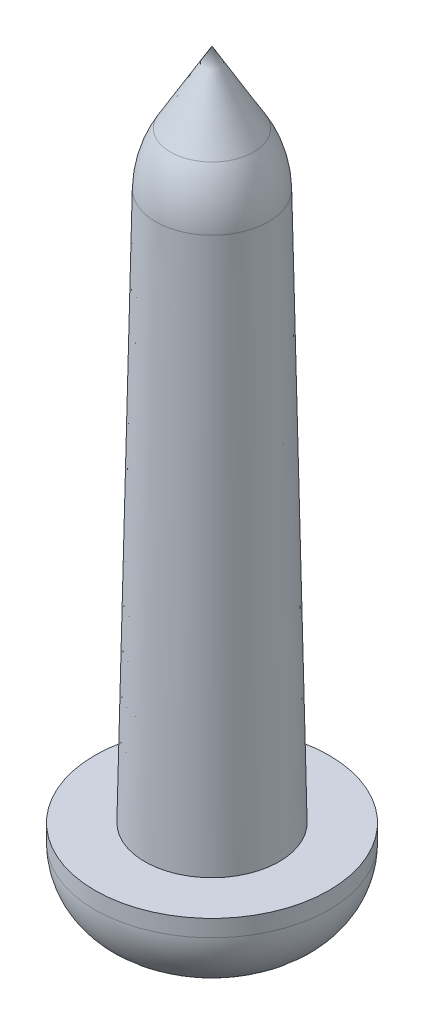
ISO-10303-21;
HEADER;
FILE_DESCRIPTION(('STEP AP214'),'2;1');
FILE_NAME('part.step','',(''),(''),'','','');
FILE_SCHEMA(('AUTOMOTIVE_DESIGN { 1 0 10303 214 1 1 1 1 }'));
ENDSEC;
DATA;
#1=APPLICATION_CONTEXT('core data for automotive mechanical design processes');
#2=APPLICATION_PROTOCOL_DEFINITION('international standard','automotive_design',2000,#1);
#3=PRODUCT_CONTEXT('',#1,'mechanical');
#4=PRODUCT('Part','Part','',(#3));
#5=PRODUCT_RELATED_PRODUCT_CATEGORY('part','',(#4));
#6=PRODUCT_DEFINITION_FORMATION('','',#4);
#7=PRODUCT_DEFINITION_CONTEXT('part definition',#1,'design');
#8=PRODUCT_DEFINITION('design','',#6,#7);
#9=PRODUCT_DEFINITION_SHAPE('','',#8);
#10=(LENGTH_UNIT() NAMED_UNIT(*) SI_UNIT(.MILLI.,.METRE.));
#11=(NAMED_UNIT(*) PLANE_ANGLE_UNIT() SI_UNIT($,.RADIAN.));
#12=(NAMED_UNIT(*) SI_UNIT($,.STERADIAN.) SOLID_ANGLE_UNIT());
#13=UNCERTAINTY_MEASURE_WITH_UNIT(LENGTH_MEASURE(1.E-05),#10,'distance_accuracy_value','');
#14=(GEOMETRIC_REPRESENTATION_CONTEXT(3) GLOBAL_UNCERTAINTY_ASSIGNED_CONTEXT((#13)) GLOBAL_UNIT_ASSIGNED_CONTEXT((#10,
#11,#12)) REPRESENTATION_CONTEXT('',''));
#15=CARTESIAN_POINT('',(0.,0.,0.));
#16=DIRECTION('',(0.,0.,1.));
#17=DIRECTION('',(1.,0.,0.));
#18=AXIS2_PLACEMENT_3D('',#15,#16,#17);
#19=CARTESIAN_POINT('',(0.,4.31540969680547E-06,0.));
#20=DIRECTION('',(0.,-1.,0.));
#21=DIRECTION('',(0.,0.,-1.));
#22=AXIS2_PLACEMENT_3D('',#19,#20,#21);
#23=PLANE('',#22);
#24=DIRECTION('',(-1.,0.,0.));
#25=VECTOR('',#24,1.);
#26=CARTESIAN_POINT('',(0.,4.31540969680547E-06,0.349999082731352));
#27=LINE('',#26,#25);
#28=CARTESIAN_POINT('',(0.652004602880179,1.16357725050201E-06,0.350000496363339));
#29=VERTEX_POINT('',#28);
#30=CARTESIAN_POINT('',(0.55,4.3154096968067E-06,0.349999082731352));
#31=VERTEX_POINT('',#30);
#32=EDGE_CURVE('E104',#29,#31,#27,.T.);
#33=ORIENTED_EDGE('',*,*,#32,.F.);
#34=CARTESIAN_POINT('',(0.,8.63081939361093E-06,0.));
#35=DIRECTION('',(0.,-1.,0.));
#36=DIRECTION('',(0.,0.,-1.));
#37=AXIS2_PLACEMENT_3D('',#34,#35,#36);
#38=CIRCLE('',#37,0.74001166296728);
#39=CARTESIAN_POINT('',(0.349998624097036,6.47311451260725E-06,0.652007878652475));
#40=VERTEX_POINT('',#39);
#41=EDGE_CURVE('E342',#29,#40,#38,.T.);
#42=ORIENTED_EDGE('',*,*,#41,.T.);
#43=DIRECTION('',(0.,0.,1.));
#44=VECTOR('',#43,1.);
#45=CARTESIAN_POINT('',(0.349999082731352,4.31540969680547E-06,0.));
#46=LINE('',#45,#44);
#47=CARTESIAN_POINT('',(0.349999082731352,4.3154096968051E-06,0.55));
#48=VERTEX_POINT('',#47);
#49=EDGE_CURVE('E124',#48,#40,#46,.T.);
#50=ORIENTED_EDGE('',*,*,#49,.F.);
#51=CARTESIAN_POINT('',(0.55,4.31540969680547E-06,0.55));
#52=DIRECTION('',(0.,-1.,0.));
#53=DIRECTION('',(0.,0.,-1.));
#54=AXIS2_PLACEMENT_3D('',#51,#52,#53);
#55=CIRCLE('',#54,0.200000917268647);
#56=EDGE_CURVE('E116',#31,#48,#55,.F.);
#57=ORIENTED_EDGE('',*,*,#56,.F.);
#58=EDGE_LOOP('',(#33,#42,#50,#57));
#59=FACE_BOUND('',#58,.T.);
#60=ADVANCED_FACE('F33',(#59),#23,.T.);
#61=DIRECTION('',(0.,0.,-1.));
#62=VECTOR('',#61,1.);
#63=CARTESIAN_POINT('',(-0.349999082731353,4.31540969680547E-06,0.));
#64=LINE('',#63,#62);
#65=CARTESIAN_POINT('',(-0.35000049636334,1.1635772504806E-06,0.652004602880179));
#66=VERTEX_POINT('',#65);
#67=CARTESIAN_POINT('',(-0.349999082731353,4.31540969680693E-06,0.55));
#68=VERTEX_POINT('',#67);
#69=EDGE_CURVE('E126',#66,#68,#64,.T.);
#70=ORIENTED_EDGE('',*,*,#69,.F.);
#71=CARTESIAN_POINT('',(-0.652007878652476,6.47311451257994E-06,0.349998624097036));
#72=VERTEX_POINT('',#71);
#73=EDGE_CURVE('E345',#66,#72,#38,.T.);
#74=ORIENTED_EDGE('',*,*,#73,.T.);
#75=DIRECTION('',(-1.,0.,0.));
#76=VECTOR('',#75,1.);
#77=CARTESIAN_POINT('',(0.,4.31540969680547E-06,0.349999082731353));
#78=LINE('',#77,#76);
#79=CARTESIAN_POINT('',(-0.55,4.31540969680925E-06,0.349999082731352));
#80=VERTEX_POINT('',#79);
#81=EDGE_CURVE('E135',#80,#72,#78,.T.);
#82=ORIENTED_EDGE('',*,*,#81,.F.);
#83=CARTESIAN_POINT('',(-0.55,4.31540969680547E-06,0.55));
#84=DIRECTION('',(0.,-1.,0.));
#85=DIRECTION('',(0.,0.,-1.));
#86=AXIS2_PLACEMENT_3D('',#83,#84,#85);
#87=CIRCLE('',#86,0.200000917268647);
#88=EDGE_CURVE('E132',#68,#80,#87,.F.);
#89=ORIENTED_EDGE('',*,*,#88,.F.);
#90=EDGE_LOOP('',(#70,#74,#82,#89));
#91=FACE_BOUND('',#90,.T.);
#92=ADVANCED_FACE('F313',(#91),#23,.T.);
#93=DIRECTION('',(1.,0.,0.));
#94=VECTOR('',#93,1.);
#95=CARTESIAN_POINT('',(0.,4.31540969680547E-06,-0.349999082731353));
#96=LINE('',#95,#94);
#97=CARTESIAN_POINT('',(-0.652004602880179,1.16357725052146E-06,-0.350000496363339));
#98=VERTEX_POINT('',#97);
#99=CARTESIAN_POINT('',(-0.55,4.31540969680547E-06,-0.349999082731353));
#100=VERTEX_POINT('',#99);
#101=EDGE_CURVE('E137',#98,#100,#96,.T.);
#102=ORIENTED_EDGE('',*,*,#101,.F.);
#103=CARTESIAN_POINT('',(-0.349998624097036,6.47311451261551E-06,-0.652007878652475));
#104=VERTEX_POINT('',#103);
#105=EDGE_CURVE('E358',#98,#104,#38,.T.);
#106=ORIENTED_EDGE('',*,*,#105,.T.);
#107=DIRECTION('',(0.,0.,-1.));
#108=VECTOR('',#107,1.);
#109=CARTESIAN_POINT('',(-0.349999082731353,4.31540969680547E-06,0.));
#110=LINE('',#109,#108);
#111=CARTESIAN_POINT('',(-0.349999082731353,4.3154096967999E-06,-0.55));
#112=VERTEX_POINT('',#111);
#113=EDGE_CURVE('E144',#112,#104,#110,.T.);
#114=ORIENTED_EDGE('',*,*,#113,.F.);
#115=CARTESIAN_POINT('',(-0.55,4.31540969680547E-06,-0.55));
#116=DIRECTION('',(0.,-1.,0.));
#117=DIRECTION('',(0.,0.,-1.));
#118=AXIS2_PLACEMENT_3D('',#115,#116,#117);
#119=CIRCLE('',#118,0.200000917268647);
#120=EDGE_CURVE('E141',#100,#112,#119,.F.);
#121=ORIENTED_EDGE('',*,*,#120,.F.);
#122=EDGE_LOOP('',(#102,#106,#114,#121));
#123=FACE_BOUND('',#122,.T.);
#124=ADVANCED_FACE('F317',(#123),#23,.T.);
#125=DIRECTION('',(0.,0.,1.));
#126=VECTOR('',#125,1.);
#127=CARTESIAN_POINT('',(0.349999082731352,4.31540969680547E-06,0.));
#128=LINE('',#127,#126);
#129=CARTESIAN_POINT('',(0.350000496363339,1.16357725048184E-06,-0.652004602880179));
#130=VERTEX_POINT('',#129);
#131=CARTESIAN_POINT('',(0.349999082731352,4.31540969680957E-06,-0.55));
#132=VERTEX_POINT('',#131);
#133=EDGE_CURVE('E146',#130,#132,#128,.T.);
#134=ORIENTED_EDGE('',*,*,#133,.F.);
#135=CARTESIAN_POINT('',(0.652007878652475,6.47311451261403E-06,-0.349998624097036));
#136=VERTEX_POINT('',#135);
#137=EDGE_CURVE('E333',#130,#136,#38,.T.);
#138=ORIENTED_EDGE('',*,*,#137,.T.);
#139=DIRECTION('',(1.,0.,0.));
#140=VECTOR('',#139,1.);
#141=CARTESIAN_POINT('',(0.,4.31540969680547E-06,-0.349999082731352));
#142=LINE('',#141,#140);
#143=CARTESIAN_POINT('',(0.55,4.31540969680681E-06,-0.349999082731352));
#144=VERTEX_POINT('',#143);
#145=EDGE_CURVE('E153',#144,#136,#142,.T.);
#146=ORIENTED_EDGE('',*,*,#145,.F.);
#147=CARTESIAN_POINT('',(0.55,4.31540969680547E-06,-0.55));
#148=DIRECTION('',(0.,-1.,0.));
#149=DIRECTION('',(0.,0.,-1.));
#150=AXIS2_PLACEMENT_3D('',#147,#148,#149);
#151=CIRCLE('',#150,0.200000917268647);
#152=EDGE_CURVE('E150',#132,#144,#151,.F.);
#153=ORIENTED_EDGE('',*,*,#152,.F.);
#154=EDGE_LOOP('',(#134,#138,#146,#153));
#155=FACE_BOUND('',#154,.T.);
#156=ADVANCED_FACE('F35',(#155),#23,.T.);
#157=CARTESIAN_POINT('',(0.,1.00000863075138,0.));
#158=DIRECTION('',(0.,-1.,0.));
#159=DIRECTION('',(0.,0.,-1.));
#160=AXIS2_PLACEMENT_3D('',#157,#158,#159);
#161=DEGENERATE_TOROIDAL_SURFACE('',#160,0.739999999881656,1.,.T.);
#162=CARTESIAN_POINT('',(0.26933841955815,0.379482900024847,-1.50020000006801));
#163=CARTESIAN_POINT('',(0.274102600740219,0.357069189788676,-1.48132507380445));
#164=CARTESIAN_POINT('',(0.278695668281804,0.335460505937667,-1.46147507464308));
#165=CARTESIAN_POINT('',(0.287512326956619,0.293981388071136,-1.41996635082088));
#166=CARTESIAN_POINT('',(0.291735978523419,0.274110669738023,-1.39830792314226));
#167=CARTESIAN_POINT('',(0.30376985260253,0.217495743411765,-1.33107012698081));
#168=CARTESIAN_POINT('',(0.310996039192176,0.183499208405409,-1.28301716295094));
#169=CARTESIAN_POINT('',(0.323683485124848,0.123809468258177,-1.18182195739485));
#170=CARTESIAN_POINT('',(0.3291441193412,0.0981192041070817,-1.12867792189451));
#171=CARTESIAN_POINT('',(0.338198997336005,0.0555193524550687,-1.01870742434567));
#172=CARTESIAN_POINT('',(0.341790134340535,0.0386243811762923,-0.961875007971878));
#173=CARTESIAN_POINT('',(0.345749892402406,0.0199951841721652,-0.875059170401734));
#174=CARTESIAN_POINT('',(0.346832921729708,0.0148999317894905,-0.845781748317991));
#175=CARTESIAN_POINT('',(0.348526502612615,0.0069322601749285,-0.786899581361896));
#176=CARTESIAN_POINT('',(0.349136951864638,0.00406032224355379,-0.757294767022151));
#177=CARTESIAN_POINT('',(0.349897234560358,0.000483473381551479,-0.698008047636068));
#178=CARTESIAN_POINT('',(0.35004789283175,-0.000225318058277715,-0.668326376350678));
#179=CARTESIAN_POINT('',(0.349919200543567,0.000380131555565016,-0.609001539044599));
#180=CARTESIAN_POINT('',(0.349640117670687,0.00169311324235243,-0.579358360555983));
#181=CARTESIAN_POINT('',(0.34916036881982,0.00395015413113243,-0.549799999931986));
#182=B_SPLINE_CURVE_WITH_KNOTS('',3,(#162,#163,#164,#165,#166,#167,#168,#169,#170,#171,#172,
#173,#174,#175,#176,#177,#178,#179,#180,#181),.UNSPECIFIED.,.F.,.F.,(4,2,2,2,2,2,2,2,2,4),(0.,
0.0890046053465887,0.177994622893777,0.354994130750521,0.532056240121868,0.709411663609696,
0.798550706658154,0.887709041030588,0.976707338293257,1.06565022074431),.UNSPECIFIED.);
#183=CARTESIAN_POINT('',(0.284428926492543,0.308487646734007,-1.43442892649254));
#184=VERTEX_POINT('',#183);
#185=EDGE_CURVE('E11',#184,#130,#182,.T.);
#186=ORIENTED_EDGE('',*,*,#185,.F.);
#187=CARTESIAN_POINT('',(-0.350200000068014,0.320863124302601,-1.43179843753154));
#188=CARTESIAN_POINT('',(-0.303864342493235,0.311157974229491,-1.43386133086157));
#189=CARTESIAN_POINT('',(-0.257100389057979,0.303497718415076,-1.43548956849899));
#190=CARTESIAN_POINT('',(-0.163042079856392,0.292112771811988,-1.43790951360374));
#191=CARTESIAN_POINT('',(-0.115747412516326,0.288390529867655,-1.43870070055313));
#192=CARTESIAN_POINT('',(-0.0212573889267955,0.284748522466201,-1.43947483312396));
#193=CARTESIAN_POINT('',(0.0259372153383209,0.284809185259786,-1.43946193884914));
#194=CARTESIAN_POINT('',(0.120143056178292,0.288692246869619,-1.4386365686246));
#195=CARTESIAN_POINT('',(0.16715439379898,0.292512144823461,-1.4378246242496));
#196=CARTESIAN_POINT('',(0.236724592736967,0.301085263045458,-1.43600235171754));
#197=CARTESIAN_POINT('',(0.259481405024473,0.304359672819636,-1.43530635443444));
#198=CARTESIAN_POINT('',(0.304927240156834,0.311876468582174,-1.43370861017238));
#199=CARTESIAN_POINT('',(0.327615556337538,0.316122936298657,-1.43280599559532));
#200=CARTESIAN_POINT('',(0.350200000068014,0.3208631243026,-1.43179843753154));
#201=B_SPLINE_CURVE_WITH_KNOTS('',3,(#187,#188,#189,#190,#191,#192,#193,#194,#195,#196,#197,
#198,#199,#200),.UNSPECIFIED.,.F.,.F.,(4,2,2,2,2,2,4),(0.,0.14208299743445,0.284254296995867,
0.425690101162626,0.567031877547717,0.63601873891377,0.705300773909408),.UNSPECIFIED.);
#202=CARTESIAN_POINT('',(-0.284428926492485,0.308487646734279,-1.43442892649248));
#203=VERTEX_POINT('',#202);
#204=EDGE_CURVE('E43',#203,#184,#201,.T.);
#205=ORIENTED_EDGE('',*,*,#204,.F.);
#206=CARTESIAN_POINT('',(-0.34916036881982,0.00395015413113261,-0.549799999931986));
#207=CARTESIAN_POINT('',(-0.349716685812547,0.00133288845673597,-0.583987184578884));
#208=CARTESIAN_POINT('',(-0.350002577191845,-1.2124734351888E-05,-0.618292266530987));
#209=CARTESIAN_POINT('',(-0.349993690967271,2.9681665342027E-05,-0.686928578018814));
#210=CARTESIAN_POINT('',(-0.349698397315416,0.00141892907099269,-0.721259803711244));
#211=CARTESIAN_POINT('',(-0.348484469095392,0.00713001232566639,-0.789774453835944));
#212=CARTESIAN_POINT('',(-0.34756406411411,0.011460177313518,-0.823957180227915));
#213=CARTESIAN_POINT('',(-0.345083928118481,0.023128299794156,-0.891760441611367));
#214=CARTESIAN_POINT('',(-0.343524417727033,0.0304652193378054,-0.925381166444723));
#215=CARTESIAN_POINT('',(-0.337924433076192,0.0568110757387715,-1.02411488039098));
#216=CARTESIAN_POINT('',(-0.332946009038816,0.0802327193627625,-1.08806501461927));
#217=CARTESIAN_POINT('',(-0.320576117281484,0.138428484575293,-1.21009001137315));
#218=CARTESIAN_POINT('',(-0.313192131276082,0.173167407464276,-1.26818236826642));
#219=CARTESIAN_POINT('',(-0.29958334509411,0.237191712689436,-1.35514117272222));
#220=CARTESIAN_POINT('',(-0.294041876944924,0.263262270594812,-1.38652660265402));
#221=CARTESIAN_POINT('',(-0.282223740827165,0.318862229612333,-1.44597253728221));
#222=CARTESIAN_POINT('',(-0.275946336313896,0.348395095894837,-1.47402965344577));
#223=CARTESIAN_POINT('',(-0.26933841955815,0.379482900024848,-1.50020000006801));
#224=B_SPLINE_CURVE_WITH_KNOTS('',3,(#206,#207,#208,#209,#210,#211,#212,#213,#214,#215,#216,
#217,#218,#219,#220,#221,#222,#223),.UNSPECIFIED.,.F.,.F.,(4,2,2,2,2,2,2,2,4),(0.,
0.10287413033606,0.205839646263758,0.309097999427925,0.412320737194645,0.615903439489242,
0.818858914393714,0.942120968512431,1.06550745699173),.UNSPECIFIED.);
#225=EDGE_CURVE('E294',#104,#203,#224,.T.);
#226=ORIENTED_EDGE('',*,*,#225,.F.);
#227=ORIENTED_EDGE('',*,*,#105,.F.);
#228=CARTESIAN_POINT('',(-1.50020000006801,0.379482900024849,-0.269338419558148));
#229=CARTESIAN_POINT('',(-1.48132507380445,0.357069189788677,-0.274102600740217));
#230=CARTESIAN_POINT('',(-1.46147507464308,0.335460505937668,-0.278695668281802));
#231=CARTESIAN_POINT('',(-1.41996635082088,0.293981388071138,-0.287512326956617));
#232=CARTESIAN_POINT('',(-1.39830792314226,0.274110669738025,-0.291735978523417));
#233=CARTESIAN_POINT('',(-1.33107012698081,0.217495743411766,-0.303769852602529));
#234=CARTESIAN_POINT('',(-1.28301716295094,0.18349920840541,-0.310996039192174));
#235=CARTESIAN_POINT('',(-1.18182195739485,0.123809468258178,-0.323683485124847));
#236=CARTESIAN_POINT('',(-1.12867792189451,0.0981192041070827,-0.329144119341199));
#237=CARTESIAN_POINT('',(-1.01870742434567,0.0555193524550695,-0.338198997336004));
#238=CARTESIAN_POINT('',(-0.96187500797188,0.0386243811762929,-0.341790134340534));
#239=CARTESIAN_POINT('',(-0.875059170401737,0.0199951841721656,-0.345749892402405));
#240=CARTESIAN_POINT('',(-0.845781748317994,0.0148999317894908,-0.346832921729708));
#241=CARTESIAN_POINT('',(-0.786899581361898,0.00693226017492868,-0.348526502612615));
#242=CARTESIAN_POINT('',(-0.757294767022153,0.00406032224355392,-0.349136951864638));
#243=CARTESIAN_POINT('',(-0.698008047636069,0.000483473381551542,-0.349897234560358));
#244=CARTESIAN_POINT('',(-0.66832637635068,-0.000225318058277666,-0.350047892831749));
#245=CARTESIAN_POINT('',(-0.6090015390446,0.000380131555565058,-0.349919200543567));
#246=CARTESIAN_POINT('',(-0.579358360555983,0.00169311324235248,-0.349640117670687));
#247=CARTESIAN_POINT('',(-0.549799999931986,0.00395015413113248,-0.34916036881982));
#248=B_SPLINE_CURVE_WITH_KNOTS('',3,(#228,#229,#230,#231,#232,#233,#234,#235,#236,#237,#238,
#239,#240,#241,#242,#243,#244,#245,#246,#247),.UNSPECIFIED.,.F.,.F.,(4,2,2,2,2,2,2,2,2,4),(0.,
0.0890046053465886,0.177994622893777,0.354994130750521,0.532056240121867,0.709411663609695,
0.798550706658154,0.887709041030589,0.976707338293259,1.06565022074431),.UNSPECIFIED.);
#249=CARTESIAN_POINT('',(-1.43442892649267,0.308487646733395,-0.284428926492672));
#250=VERTEX_POINT('',#249);
#251=EDGE_CURVE('E293',#250,#98,#248,.T.);
#252=ORIENTED_EDGE('',*,*,#251,.F.);
#253=CARTESIAN_POINT('',(-1.43179843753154,0.320863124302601,0.350200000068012));
#254=CARTESIAN_POINT('',(-1.43386133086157,0.311157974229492,0.303864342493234));
#255=CARTESIAN_POINT('',(-1.435489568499,0.303497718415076,0.257100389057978));
#256=CARTESIAN_POINT('',(-1.43790951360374,0.292112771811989,0.163042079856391));
#257=CARTESIAN_POINT('',(-1.43870070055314,0.288390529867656,0.115747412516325));
#258=CARTESIAN_POINT('',(-1.43947483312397,0.284748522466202,0.021257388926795));
#259=CARTESIAN_POINT('',(-1.43946193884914,0.284809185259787,-0.0259372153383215));
#260=CARTESIAN_POINT('',(-1.4386365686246,0.28869224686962,-0.120143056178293));
#261=CARTESIAN_POINT('',(-1.4378246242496,0.292512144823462,-0.16715439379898));
#262=CARTESIAN_POINT('',(-1.43600235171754,0.301085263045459,-0.236724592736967));
#263=CARTESIAN_POINT('',(-1.43530635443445,0.304359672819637,-0.259481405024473));
#264=CARTESIAN_POINT('',(-1.43370861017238,0.311876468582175,-0.304927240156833));
#265=CARTESIAN_POINT('',(-1.43280599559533,0.316122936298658,-0.327615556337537));
#266=CARTESIAN_POINT('',(-1.43179843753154,0.320863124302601,-0.350200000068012));
#267=B_SPLINE_CURVE_WITH_KNOTS('',3,(#253,#254,#255,#256,#257,#258,#259,#260,#261,#262,#263,
#264,#265,#266),.UNSPECIFIED.,.F.,.F.,(4,2,2,2,2,2,4),(0.,0.142082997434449,0.284254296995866,
0.425690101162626,0.567031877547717,0.636018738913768,0.705300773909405),.UNSPECIFIED.);
#268=CARTESIAN_POINT('',(-1.43442892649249,0.308487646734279,0.284428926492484));
#269=VERTEX_POINT('',#268);
#270=EDGE_CURVE('E266',#269,#250,#267,.T.);
#271=ORIENTED_EDGE('',*,*,#270,.F.);
#272=CARTESIAN_POINT('',(-0.549799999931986,0.00395015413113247,0.34916036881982));
#273=CARTESIAN_POINT('',(-0.583987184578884,0.0013328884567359,0.349716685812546));
#274=CARTESIAN_POINT('',(-0.618292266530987,-1.21247343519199E-05,0.350002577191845));
#275=CARTESIAN_POINT('',(-0.686928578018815,2.96816653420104E-05,0.34999369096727));
#276=CARTESIAN_POINT('',(-0.721259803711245,0.00141892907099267,0.349698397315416));
#277=CARTESIAN_POINT('',(-0.789774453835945,0.00713001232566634,0.348484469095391));
#278=CARTESIAN_POINT('',(-0.823957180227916,0.0114601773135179,0.347564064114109));
#279=CARTESIAN_POINT('',(-0.891760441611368,0.0231282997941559,0.34508392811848));
#280=CARTESIAN_POINT('',(-0.925381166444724,0.0304652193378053,0.343524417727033));
#281=CARTESIAN_POINT('',(-1.02411488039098,0.0568110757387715,0.337924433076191));
#282=CARTESIAN_POINT('',(-1.08806501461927,0.0802327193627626,0.332946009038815));
#283=CARTESIAN_POINT('',(-1.21009001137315,0.138428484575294,0.320576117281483));
#284=CARTESIAN_POINT('',(-1.26818236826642,0.173167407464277,0.313192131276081));
#285=CARTESIAN_POINT('',(-1.35514117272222,0.237191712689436,0.299583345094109));
#286=CARTESIAN_POINT('',(-1.38652660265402,0.263262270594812,0.294041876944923));
#287=CARTESIAN_POINT('',(-1.44597253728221,0.318862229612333,0.282223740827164));
#288=CARTESIAN_POINT('',(-1.47402965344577,0.348395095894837,0.275946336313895));
#289=CARTESIAN_POINT('',(-1.50020000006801,0.379482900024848,0.269338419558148));
#290=B_SPLINE_CURVE_WITH_KNOTS('',3,(#272,#273,#274,#275,#276,#277,#278,#279,#280,#281,#282,
#283,#284,#285,#286,#287,#288,#289),.UNSPECIFIED.,.F.,.F.,(4,2,2,2,2,2,2,2,4),(0.,
0.10287413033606,0.205839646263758,0.309097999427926,0.412320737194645,0.615903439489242,
0.818858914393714,0.942120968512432,1.06550745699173),.UNSPECIFIED.);
#291=EDGE_CURVE('E260',#72,#269,#290,.T.);
#292=ORIENTED_EDGE('',*,*,#291,.F.);
#293=ORIENTED_EDGE('',*,*,#73,.F.);
#294=CARTESIAN_POINT('',(-0.26933841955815,0.379482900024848,1.50020000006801));
#295=CARTESIAN_POINT('',(-0.274102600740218,0.357069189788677,1.48132507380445));
#296=CARTESIAN_POINT('',(-0.278695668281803,0.335460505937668,1.46147507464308));
#297=CARTESIAN_POINT('',(-0.287512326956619,0.293981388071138,1.41996635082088));
#298=CARTESIAN_POINT('',(-0.291735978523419,0.274110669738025,1.39830792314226));
#299=CARTESIAN_POINT('',(-0.30376985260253,0.217495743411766,1.33107012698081));
#300=CARTESIAN_POINT('',(-0.310996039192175,0.18349920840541,1.28301716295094));
#301=CARTESIAN_POINT('',(-0.323683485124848,0.123809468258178,1.18182195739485));
#302=CARTESIAN_POINT('',(-0.3291441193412,0.0981192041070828,1.12867792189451));
#303=CARTESIAN_POINT('',(-0.338198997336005,0.0555193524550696,1.01870742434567));
#304=CARTESIAN_POINT('',(-0.341790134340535,0.0386243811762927,0.96187500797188));
#305=CARTESIAN_POINT('',(-0.345749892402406,0.0199951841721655,0.875059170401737));
#306=CARTESIAN_POINT('',(-0.346832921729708,0.0148999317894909,0.845781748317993));
#307=CARTESIAN_POINT('',(-0.348526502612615,0.00693226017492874,0.786899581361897));
#308=CARTESIAN_POINT('',(-0.349136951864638,0.00406032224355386,0.757294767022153));
#309=CARTESIAN_POINT('',(-0.349897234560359,0.000483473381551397,0.698008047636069));
#310=CARTESIAN_POINT('',(-0.35004789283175,-0.000225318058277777,0.668326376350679));
#311=CARTESIAN_POINT('',(-0.349919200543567,0.000380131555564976,0.6090015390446));
#312=CARTESIAN_POINT('',(-0.349640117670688,0.00169311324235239,0.579358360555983));
#313=CARTESIAN_POINT('',(-0.34916036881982,0.00395015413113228,0.549799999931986));
#314=B_SPLINE_CURVE_WITH_KNOTS('',3,(#294,#295,#296,#297,#298,#299,#300,#301,#302,#303,#304,
#305,#306,#307,#308,#309,#310,#311,#312,#313),.UNSPECIFIED.,.F.,.F.,(4,2,2,2,2,2,2,2,2,4),(0.,
0.0890046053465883,0.177994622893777,0.354994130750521,0.532056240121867,0.709411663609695,
0.798550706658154,0.887709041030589,0.976707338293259,1.06565022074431),.UNSPECIFIED.);
#315=CARTESIAN_POINT('',(-0.284428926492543,0.308487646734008,1.43442892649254));
#316=VERTEX_POINT('',#315);
#317=EDGE_CURVE('E259',#316,#66,#314,.T.);
#318=ORIENTED_EDGE('',*,*,#317,.F.);
#319=CARTESIAN_POINT('',(0.350200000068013,0.3208631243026,1.43179843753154));
#320=CARTESIAN_POINT('',(0.303864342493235,0.311157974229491,1.43386133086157));
#321=CARTESIAN_POINT('',(0.257100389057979,0.303497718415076,1.43548956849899));
#322=CARTESIAN_POINT('',(0.163042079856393,0.292112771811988,1.43790951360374));
#323=CARTESIAN_POINT('',(0.115747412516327,0.288390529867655,1.43870070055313));
#324=CARTESIAN_POINT('',(0.0212573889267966,0.284748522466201,1.43947483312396));
#325=CARTESIAN_POINT('',(-0.0259372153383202,0.284809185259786,1.43946193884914));
#326=CARTESIAN_POINT('',(-0.120143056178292,0.288692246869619,1.4386365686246));
#327=CARTESIAN_POINT('',(-0.16715439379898,0.292512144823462,1.4378246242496));
#328=CARTESIAN_POINT('',(-0.236724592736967,0.301085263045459,1.43600235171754));
#329=CARTESIAN_POINT('',(-0.259481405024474,0.304359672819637,1.43530635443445));
#330=CARTESIAN_POINT('',(-0.304927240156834,0.311876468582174,1.43370861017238));
#331=CARTESIAN_POINT('',(-0.327615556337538,0.316122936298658,1.43280599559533));
#332=CARTESIAN_POINT('',(-0.350200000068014,0.320863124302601,1.43179843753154));
#333=B_SPLINE_CURVE_WITH_KNOTS('',3,(#319,#320,#321,#322,#323,#324,#325,#326,#327,#328,#329,
#330,#331,#332),.UNSPECIFIED.,.F.,.F.,(4,2,2,2,2,2,4),(0.,0.142082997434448,0.284254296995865,
0.425690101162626,0.567031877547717,0.636018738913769,0.705300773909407),.UNSPECIFIED.);
#334=CARTESIAN_POINT('',(0.284428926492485,0.308487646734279,1.43442892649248));
#335=VERTEX_POINT('',#334);
#336=EDGE_CURVE('E230',#335,#316,#333,.T.);
#337=ORIENTED_EDGE('',*,*,#336,.F.);
#338=CARTESIAN_POINT('',(0.349160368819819,0.00395015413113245,0.549799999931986));
#339=CARTESIAN_POINT('',(0.349716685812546,0.00133288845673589,0.583987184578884));
#340=CARTESIAN_POINT('',(0.350002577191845,-1.21247343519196E-05,0.618292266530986));
#341=CARTESIAN_POINT('',(0.34999369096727,2.96816653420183E-05,0.686928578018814));
#342=CARTESIAN_POINT('',(0.349698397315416,0.00141892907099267,0.721259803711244));
#343=CARTESIAN_POINT('',(0.348484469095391,0.00713001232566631,0.789774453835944));
#344=CARTESIAN_POINT('',(0.347564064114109,0.0114601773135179,0.823957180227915));
#345=CARTESIAN_POINT('',(0.34508392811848,0.0231282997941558,0.891760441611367));
#346=CARTESIAN_POINT('',(0.343524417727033,0.0304652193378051,0.925381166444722));
#347=CARTESIAN_POINT('',(0.337924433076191,0.0568110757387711,1.02411488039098));
#348=CARTESIAN_POINT('',(0.332946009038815,0.080232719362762,1.08806501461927));
#349=CARTESIAN_POINT('',(0.320576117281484,0.138428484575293,1.21009001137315));
#350=CARTESIAN_POINT('',(0.313192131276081,0.173167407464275,1.26818236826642));
#351=CARTESIAN_POINT('',(0.299583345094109,0.237191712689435,1.35514117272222));
#352=CARTESIAN_POINT('',(0.294041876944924,0.263262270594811,1.38652660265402));
#353=CARTESIAN_POINT('',(0.282223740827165,0.318862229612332,1.44597253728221));
#354=CARTESIAN_POINT('',(0.275946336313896,0.348395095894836,1.47402965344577));
#355=CARTESIAN_POINT('',(0.269338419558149,0.379482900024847,1.50020000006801));
#356=B_SPLINE_CURVE_WITH_KNOTS('',3,(#338,#339,#340,#341,#342,#343,#344,#345,#346,#347,#348,
#349,#350,#351,#352,#353,#354,#355),.UNSPECIFIED.,.F.,.F.,(4,2,2,2,2,2,2,2,4),(0.,
0.10287413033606,0.205839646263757,0.309097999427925,0.412320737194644,0.615903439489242,
0.818858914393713,0.94212096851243,1.06550745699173),.UNSPECIFIED.);
#357=EDGE_CURVE('E217',#40,#335,#356,.T.);
#358=ORIENTED_EDGE('',*,*,#357,.F.);
#359=ORIENTED_EDGE('',*,*,#41,.F.);
#360=CARTESIAN_POINT('',(1.50020000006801,0.379482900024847,0.26933841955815));
#361=CARTESIAN_POINT('',(1.48132507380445,0.357069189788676,0.274102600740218));
#362=CARTESIAN_POINT('',(1.46147507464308,0.335460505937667,0.278695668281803));
#363=CARTESIAN_POINT('',(1.41996635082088,0.293981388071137,0.287512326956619));
#364=CARTESIAN_POINT('',(1.39830792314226,0.274110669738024,0.291735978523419));
#365=CARTESIAN_POINT('',(1.33107012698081,0.217495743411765,0.30376985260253));
#366=CARTESIAN_POINT('',(1.28301716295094,0.183499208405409,0.310996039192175));
#367=CARTESIAN_POINT('',(1.18182195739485,0.123809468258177,0.323683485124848));
#368=CARTESIAN_POINT('',(1.12867792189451,0.098119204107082,0.329144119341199));
#369=CARTESIAN_POINT('',(1.01870742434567,0.0555193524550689,0.338198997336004));
#370=CARTESIAN_POINT('',(0.961875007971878,0.0386243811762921,0.341790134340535));
#371=CARTESIAN_POINT('',(0.875059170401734,0.0199951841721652,0.345749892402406));
#372=CARTESIAN_POINT('',(0.845781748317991,0.0148999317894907,0.346832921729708));
#373=CARTESIAN_POINT('',(0.786899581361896,0.00693226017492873,0.348526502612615));
#374=CARTESIAN_POINT('',(0.757294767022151,0.00406032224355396,0.349136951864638));
#375=CARTESIAN_POINT('',(0.698008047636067,0.000483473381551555,0.349897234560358));
#376=CARTESIAN_POINT('',(0.668326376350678,-0.000225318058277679,0.35004789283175));
#377=CARTESIAN_POINT('',(0.609001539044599,0.00038013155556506,0.349919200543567));
#378=CARTESIAN_POINT('',(0.579358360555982,0.00169311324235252,0.349640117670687));
#379=CARTESIAN_POINT('',(0.549799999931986,0.00395015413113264,0.34916036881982));
#380=B_SPLINE_CURVE_WITH_KNOTS('',3,(#360,#361,#362,#363,#364,#365,#366,#367,#368,#369,#370,
#371,#372,#373,#374,#375,#376,#377,#378,#379),.UNSPECIFIED.,.F.,.F.,(4,2,2,2,2,2,2,2,2,4),(0.,
0.0890046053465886,0.177994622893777,0.354994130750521,0.532056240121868,0.709411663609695,
0.798550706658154,0.887709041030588,0.976707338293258,1.06565022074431),.UNSPECIFIED.);
#381=CARTESIAN_POINT('',(1.43442892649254,0.308487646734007,0.284428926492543));
#382=VERTEX_POINT('',#381);
#383=EDGE_CURVE('E111',#382,#29,#380,.T.);
#384=ORIENTED_EDGE('',*,*,#383,.F.);
#385=CARTESIAN_POINT('',(1.43179843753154,0.3208631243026,-0.350200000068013));
#386=CARTESIAN_POINT('',(1.43386133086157,0.311157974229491,-0.303864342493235));
#387=CARTESIAN_POINT('',(1.43548956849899,0.303497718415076,-0.257100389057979));
#388=CARTESIAN_POINT('',(1.43790951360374,0.292112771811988,-0.163042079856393));
#389=CARTESIAN_POINT('',(1.43870070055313,0.288390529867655,-0.115747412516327));
#390=CARTESIAN_POINT('',(1.43947483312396,0.284748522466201,-0.0212573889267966));
#391=CARTESIAN_POINT('',(1.43946193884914,0.284809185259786,0.0259372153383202));
#392=CARTESIAN_POINT('',(1.4386365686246,0.288692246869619,0.120143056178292));
#393=CARTESIAN_POINT('',(1.4378246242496,0.292512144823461,0.16715439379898));
#394=CARTESIAN_POINT('',(1.43600235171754,0.301085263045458,0.236724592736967));
#395=CARTESIAN_POINT('',(1.43530635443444,0.304359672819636,0.259481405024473));
#396=CARTESIAN_POINT('',(1.43370861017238,0.311876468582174,0.304927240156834));
#397=CARTESIAN_POINT('',(1.43280599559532,0.316122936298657,0.327615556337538));
#398=CARTESIAN_POINT('',(1.43179843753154,0.3208631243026,0.350200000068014));
#399=B_SPLINE_CURVE_WITH_KNOTS('',3,(#385,#386,#387,#388,#389,#390,#391,#392,#393,#394,#395,
#396,#397,#398),.UNSPECIFIED.,.F.,.F.,(4,2,2,2,2,2,4),(0.,0.142082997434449,0.284254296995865,
0.425690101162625,0.567031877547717,0.636018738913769,0.705300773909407),.UNSPECIFIED.);
#400=CARTESIAN_POINT('',(1.43442892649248,0.308487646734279,-0.284428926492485));
#401=VERTEX_POINT('',#400);
#402=EDGE_CURVE('E218',#401,#382,#399,.T.);
#403=ORIENTED_EDGE('',*,*,#402,.F.);
#404=CARTESIAN_POINT('',(0.549799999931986,0.00395015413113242,-0.34916036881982));
#405=CARTESIAN_POINT('',(0.583987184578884,0.00133288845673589,-0.349716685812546));
#406=CARTESIAN_POINT('',(0.618292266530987,-1.21247343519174E-05,-0.350002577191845));
#407=CARTESIAN_POINT('',(0.686928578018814,2.96816653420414E-05,-0.34999369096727));
#408=CARTESIAN_POINT('',(0.721259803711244,0.0014189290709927,-0.349698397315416));
#409=CARTESIAN_POINT('',(0.789774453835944,0.00713001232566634,-0.348484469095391));
#410=CARTESIAN_POINT('',(0.823957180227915,0.0114601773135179,-0.34756406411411));
#411=CARTESIAN_POINT('',(0.891760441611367,0.0231282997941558,-0.34508392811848));
#412=CARTESIAN_POINT('',(0.925381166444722,0.0304652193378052,-0.343524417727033));
#413=CARTESIAN_POINT('',(1.02411488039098,0.0568110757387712,-0.337924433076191));
#414=CARTESIAN_POINT('',(1.08806501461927,0.0802327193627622,-0.332946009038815));
#415=CARTESIAN_POINT('',(1.21009001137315,0.138428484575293,-0.320576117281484));
#416=CARTESIAN_POINT('',(1.26818236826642,0.173167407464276,-0.313192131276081));
#417=CARTESIAN_POINT('',(1.35514117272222,0.237191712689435,-0.299583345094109));
#418=CARTESIAN_POINT('',(1.38652660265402,0.263262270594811,-0.294041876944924));
#419=CARTESIAN_POINT('',(1.44597253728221,0.318862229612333,-0.282223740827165));
#420=CARTESIAN_POINT('',(1.47402965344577,0.348395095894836,-0.275946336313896));
#421=CARTESIAN_POINT('',(1.50020000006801,0.379482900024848,-0.269338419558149));
#422=B_SPLINE_CURVE_WITH_KNOTS('',3,(#404,#405,#406,#407,#408,#409,#410,#411,#412,#413,#414,
#415,#416,#417,#418,#419,#420,#421),.UNSPECIFIED.,.F.,.F.,(4,2,2,2,2,2,2,2,4),(0.,
0.10287413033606,0.205839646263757,0.309097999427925,0.412320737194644,0.615903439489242,
0.818858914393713,0.942120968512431,1.06550745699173),.UNSPECIFIED.);
#423=EDGE_CURVE('E210',#136,#401,#422,.T.);
#424=ORIENTED_EDGE('',*,*,#423,.F.);
#425=ORIENTED_EDGE('',*,*,#137,.F.);
#426=EDGE_LOOP('',(#186,#205,#226,#227,#252,#271,#292,#293,#318,#337,#358,#359,#384,#403,#424,#425));
#427=FACE_BOUND('',#426,.T.);
#428=CARTESIAN_POINT('',(0.,1.00000863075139,0.));
#429=DIRECTION('',(0.,-1.,0.));
#430=DIRECTION('',(0.,0.,-1.));
#431=AXIS2_PLACEMENT_3D('',#428,#429,#430);
#432=CIRCLE('',#431,1.73999999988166);
#433=CARTESIAN_POINT('',(0.,1.00000863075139,-1.73999999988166));
#434=VERTEX_POINT('',#433);
#435=EDGE_CURVE('E349',#434,#434,#432,.T.);
#436=ORIENTED_EDGE('',*,*,#435,.T.);
#437=EDGE_LOOP('',(#436));
#438=FACE_BOUND('',#437,.T.);
#439=ADVANCED_FACE('F185',(#427,#438),#161,.T.);
#440=CARTESIAN_POINT('',(0.,0.,0.));
#441=DIRECTION('',(0.,-1.,0.));
#442=DIRECTION('',(0.,0.,-1.));
#443=AXIS2_PLACEMENT_3D('',#440,#441,#442);
#444=CYLINDRICAL_SURFACE('',#443,1.73999999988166);
#445=CARTESIAN_POINT('',(0.,1.25,0.));
#446=DIRECTION('',(0.,-1.,0.));
#447=DIRECTION('',(0.,0.,-1.));
#448=AXIS2_PLACEMENT_3D('',#445,#446,#447);
#449=CIRCLE('',#448,1.73999999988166);
#450=CARTESIAN_POINT('',(0.,1.25,-1.73999999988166));
#451=VERTEX_POINT('',#450);
#452=EDGE_CURVE('E435',#451,#451,#449,.T.);
#453=ORIENTED_EDGE('',*,*,#452,.T.);
#454=EDGE_LOOP('',(#453));
#455=FACE_BOUND('',#454,.T.);
#456=ORIENTED_EDGE('',*,*,#435,.F.);
#457=EDGE_LOOP('',(#456));
#458=FACE_BOUND('',#457,.T.);
#459=ADVANCED_FACE('F325',(#455,#458),#444,.T.);
#460=CARTESIAN_POINT('',(1.73999999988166,1.25,0.));
#461=DIRECTION('',(0.,1.,0.));
#462=DIRECTION('',(0.,0.,1.));
#463=AXIS2_PLACEMENT_3D('',#460,#461,#462);
#464=PLANE('',#463);
#465=CARTESIAN_POINT('',(0.,1.25,0.));
#466=DIRECTION('',(0.,-1.,0.));
#467=DIRECTION('',(0.,0.,-1.));
#468=AXIS2_PLACEMENT_3D('',#465,#466,#467);
#469=CIRCLE('',#468,1.);
#470=CARTESIAN_POINT('',(0.,1.25,-1.));
#471=VERTEX_POINT('',#470);
#472=EDGE_CURVE('E433',#471,#471,#469,.T.);
#473=ORIENTED_EDGE('',*,*,#472,.T.);
#474=EDGE_LOOP('',(#473));
#475=FACE_BOUND('',#474,.T.);
#476=ORIENTED_EDGE('',*,*,#452,.F.);
#477=EDGE_LOOP('',(#476));
#478=FACE_BOUND('',#477,.T.);
#479=ADVANCED_FACE('F443',(#475,#478),#464,.T.);
#480=CARTESIAN_POINT('',(0.,1.25,0.));
#481=DIRECTION('',(0.,-1.,0.));
#482=DIRECTION('',(0.,0.,-1.));
#483=AXIS2_PLACEMENT_3D('',#480,#481,#482);
#484=CONICAL_SURFACE('',#483,1.,0.0198740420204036);
#485=CARTESIAN_POINT('',(0.,9.40604706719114,0.));
#486=DIRECTION('',(0.,-1.,0.));
#487=DIRECTION('',(0.,0.,-1.));
#488=AXIS2_PLACEMENT_3D('',#485,#486,#487);
#489=CIRCLE('',#488,0.8378850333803);
#490=CARTESIAN_POINT('',(0.,9.40604706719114,-0.8378850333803));
#491=VERTEX_POINT('',#490);
#492=EDGE_CURVE('E430',#491,#491,#489,.T.);
#493=ORIENTED_EDGE('',*,*,#492,.T.);
#494=EDGE_LOOP('',(#493));
#495=FACE_BOUND('',#494,.T.);
#496=ORIENTED_EDGE('',*,*,#472,.F.);
#497=EDGE_LOOP('',(#496));
#498=FACE_BOUND('',#497,.T.);
#499=ADVANCED_FACE('F447',(#495,#498),#484,.T.);
#500=CARTESIAN_POINT('',(0.,9.3737535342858,0.));
#501=DIRECTION('',(0.,-1.,0.));
#502=DIRECTION('',(0.,0.,-1.));
#503=AXIS2_PLACEMENT_3D('',#500,#501,#502);
#504=DEGENERATE_TOROIDAL_SURFACE('',#503,0.786811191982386,1.62501713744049,.F.);
#505=CARTESIAN_POINT('',(0.,10.1925525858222,0.));
#506=DIRECTION('',(0.,-1.,0.));
#507=DIRECTION('',(0.,0.,-1.));
#508=AXIS2_PLACEMENT_3D('',#505,#506,#507);
#509=CIRCLE('',#508,0.616844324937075);
#510=CARTESIAN_POINT('',(0.,10.1925525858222,-0.616844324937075));
#511=VERTEX_POINT('',#510);
#512=EDGE_CURVE('E427',#511,#511,#509,.T.);
#513=ORIENTED_EDGE('',*,*,#512,.T.);
#514=EDGE_LOOP('',(#513));
#515=FACE_BOUND('',#514,.T.);
#516=ORIENTED_EDGE('',*,*,#492,.F.);
#517=EDGE_LOOP('',(#516));
#518=FACE_BOUND('',#517,.T.);
#519=ADVANCED_FACE('F452',(#515,#518),#504,.F.);
#520=CARTESIAN_POINT('',(0.,10.1925525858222,0.));
#521=DIRECTION('',(0.,-1.,0.));
#522=DIRECTION('',(0.,0.,-1.));
#523=AXIS2_PLACEMENT_3D('',#520,#521,#522);
#524=CONICAL_SURFACE('',#523,0.616844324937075,0.528074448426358);
#525=CARTESIAN_POINT('',(0.,11.25,0.));
#526=VERTEX_POINT('',#525);
#527=VERTEX_LOOP('',#526);
#528=FACE_BOUND('',#527,.T.);
#529=ORIENTED_EDGE('',*,*,#512,.F.);
#530=EDGE_LOOP('',(#529));
#531=FACE_BOUND('',#530,.T.);
#532=ADVANCED_FACE('F207',(#528,#531),#524,.T.);
#533=CARTESIAN_POINT('',(1.5,0.,0.35));
#534=DIRECTION('',(0.978147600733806,0.20791169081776,0.));
#535=DIRECTION('',(-0.20791169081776,0.978147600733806,0.));
#536=AXIS2_PLACEMENT_3D('',#533,#534,#535);
#537=PLANE('',#536);
#538=ORIENTED_EDGE('',*,*,#402,.T.);
#539=DIRECTION('',(0.203558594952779,-0.957667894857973,0.203558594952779));
#540=VECTOR('',#539,1.);
#541=CARTESIAN_POINT('',(1.5,0.,0.35));
#542=LINE('',#541,#540);
#543=CARTESIAN_POINT('',(1.28744343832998,1.,0.137443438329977));
#544=VERTEX_POINT('',#543);
#545=EDGE_CURVE('E52',#544,#382,#542,.T.);
#546=ORIENTED_EDGE('',*,*,#545,.F.);
#547=DIRECTION('',(0.,0.,1.));
#548=VECTOR('',#547,1.);
#549=CARTESIAN_POINT('',(1.28744343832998,1.,-0.549999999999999));
#550=LINE('',#549,#548);
#551=CARTESIAN_POINT('',(1.28744343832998,1.,-0.137443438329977));
#552=VERTEX_POINT('',#551);
#553=EDGE_CURVE('E155',#552,#544,#550,.T.);
#554=ORIENTED_EDGE('',*,*,#553,.F.);
#555=DIRECTION('',(0.20355859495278,-0.957667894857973,-0.203558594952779));
#556=VECTOR('',#555,1.);
#557=CARTESIAN_POINT('',(1.5,0.,-0.35));
#558=LINE('',#557,#556);
#559=EDGE_CURVE('E158',#552,#401,#558,.T.);
#560=ORIENTED_EDGE('',*,*,#559,.T.);
#561=EDGE_LOOP('',(#538,#546,#554,#560));
#562=FACE_BOUND('',#561,.T.);
#563=ADVANCED_FACE('F205',(#562),#537,.F.);
#564=CARTESIAN_POINT('',(1.5,0.,-0.35));
#565=DIRECTION('',(0.,0.20791169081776,-0.978147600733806));
#566=DIRECTION('',(0.,0.978147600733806,0.20791169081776));
#567=AXIS2_PLACEMENT_3D('',#564,#565,#566);
#568=PLANE('',#567);
#569=ORIENTED_EDGE('',*,*,#423,.T.);
#570=ORIENTED_EDGE('',*,*,#559,.F.);
#571=DIRECTION('',(1.,0.,0.));
#572=VECTOR('',#571,1.);
#573=CARTESIAN_POINT('',(0.55,1.,-0.137443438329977));
#574=LINE('',#573,#572);
#575=CARTESIAN_POINT('',(0.55,1.,-0.137443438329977));
#576=VERTEX_POINT('',#575);
#577=EDGE_CURVE('E382',#576,#552,#574,.T.);
#578=ORIENTED_EDGE('',*,*,#577,.F.);
#579=DIRECTION('',(0.,-0.978147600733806,-0.20791169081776));
#580=VECTOR('',#579,1.);
#581=CARTESIAN_POINT('',(0.55,0.,-0.35));
#582=LINE('',#581,#580);
#583=EDGE_CURVE('E156',#576,#144,#582,.T.);
#584=ORIENTED_EDGE('',*,*,#583,.T.);
#585=ORIENTED_EDGE('',*,*,#145,.T.);
#586=EDGE_LOOP('',(#569,#570,#578,#584,#585));
#587=FACE_BOUND('',#586,.T.);
#588=ADVANCED_FACE('F200',(#587),#568,.F.);
#589=CARTESIAN_POINT('',(0.55,0.,-0.55));
#590=DIRECTION('',(0.,1.,0.));
#591=DIRECTION('',(0.,0.,-1.));
#592=AXIS2_PLACEMENT_3D('',#589,#590,#591);
#593=CONICAL_SURFACE('',#592,0.2,0.20943951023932);
#594=ORIENTED_EDGE('',*,*,#152,.T.);
#595=ORIENTED_EDGE('',*,*,#583,.F.);
#596=CARTESIAN_POINT('',(0.55,1.,-0.55));
#597=DIRECTION('',(0.,-1.,0.));
#598=DIRECTION('',(0.,0.,-1.));
#599=AXIS2_PLACEMENT_3D('',#596,#597,#598);
#600=CIRCLE('',#599,0.412556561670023);
#601=CARTESIAN_POINT('',(0.137443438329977,1.,-0.55));
#602=VERTEX_POINT('',#601);
#603=EDGE_CURVE('E391',#602,#576,#600,.F.);
#604=ORIENTED_EDGE('',*,*,#603,.F.);
#605=DIRECTION('',(0.20791169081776,-0.978147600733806,0.));
#606=VECTOR('',#605,1.);
#607=CARTESIAN_POINT('',(0.35,0.,-0.55));
#608=LINE('',#607,#606);
#609=EDGE_CURVE('E159',#602,#132,#608,.T.);
#610=ORIENTED_EDGE('',*,*,#609,.T.);
#611=EDGE_LOOP('',(#594,#595,#604,#610));
#612=FACE_BOUND('',#611,.T.);
#613=ADVANCED_FACE('F194',(#612),#593,.T.);
#614=CARTESIAN_POINT('',(0.350000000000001,0.,-1.5));
#615=DIRECTION('',(0.978147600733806,0.20791169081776,0.));
#616=DIRECTION('',(-0.20791169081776,0.978147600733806,0.));
#617=AXIS2_PLACEMENT_3D('',#614,#615,#616);
#618=PLANE('',#617);
#619=ORIENTED_EDGE('',*,*,#185,.T.);
#620=ORIENTED_EDGE('',*,*,#133,.T.);
#621=ORIENTED_EDGE('',*,*,#609,.F.);
#622=DIRECTION('',(0.,0.,1.));
#623=VECTOR('',#622,1.);
#624=CARTESIAN_POINT('',(0.137443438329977,1.,-0.55));
#625=LINE('',#624,#623);
#626=CARTESIAN_POINT('',(0.137443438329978,1.,-1.28744343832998));
#627=VERTEX_POINT('',#626);
#628=EDGE_CURVE('E393',#627,#602,#625,.T.);
#629=ORIENTED_EDGE('',*,*,#628,.F.);
#630=DIRECTION('',(0.20355859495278,-0.957667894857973,-0.203558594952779));
#631=VECTOR('',#630,1.);
#632=CARTESIAN_POINT('',(0.350000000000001,0.,-1.5));
#633=LINE('',#632,#631);
#634=EDGE_CURVE('E162',#627,#184,#633,.T.);
#635=ORIENTED_EDGE('',*,*,#634,.T.);
#636=EDGE_LOOP('',(#619,#620,#621,#629,#635));
#637=FACE_BOUND('',#636,.T.);
#638=ADVANCED_FACE('F188',(#637),#618,.F.);
#639=CARTESIAN_POINT('',(0.350000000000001,0.,-1.5));
#640=DIRECTION('',(0.,0.20791169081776,-0.978147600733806));
#641=DIRECTION('',(0.,0.978147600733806,0.20791169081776));
#642=AXIS2_PLACEMENT_3D('',#639,#640,#641);
#643=PLANE('',#642);
#644=ORIENTED_EDGE('',*,*,#204,.T.);
#645=ORIENTED_EDGE('',*,*,#634,.F.);
#646=DIRECTION('',(1.,0.,0.));
#647=VECTOR('',#646,1.);
#648=CARTESIAN_POINT('',(0.550000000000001,1.,-1.28744343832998));
#649=LINE('',#648,#647);
#650=CARTESIAN_POINT('',(-0.137443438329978,1.,-1.28744343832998));
#651=VERTEX_POINT('',#650);
#652=EDGE_CURVE('E396',#651,#627,#649,.T.);
#653=ORIENTED_EDGE('',*,*,#652,.F.);
#654=DIRECTION('',(-0.203558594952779,-0.957667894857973,-0.20355859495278));
#655=VECTOR('',#654,1.);
#656=CARTESIAN_POINT('',(-0.35,0.,-1.5));
#657=LINE('',#656,#655);
#658=EDGE_CURVE('E165',#651,#203,#657,.T.);
#659=ORIENTED_EDGE('',*,*,#658,.T.);
#660=EDGE_LOOP('',(#644,#645,#653,#659));
#661=FACE_BOUND('',#660,.T.);
#662=ADVANCED_FACE('F193',(#661),#643,.F.);
#663=CARTESIAN_POINT('',(-0.35,0.,-1.5));
#664=DIRECTION('',(-0.978147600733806,0.20791169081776,0.));
#665=DIRECTION('',(-0.20791169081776,-0.978147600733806,0.));
#666=AXIS2_PLACEMENT_3D('',#663,#664,#665);
#667=PLANE('',#666);
#668=ORIENTED_EDGE('',*,*,#225,.T.);
#669=ORIENTED_EDGE('',*,*,#658,.F.);
#670=DIRECTION('',(0.,0.,-1.));
#671=VECTOR('',#670,1.);
#672=CARTESIAN_POINT('',(-0.137443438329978,1.,-0.55));
#673=LINE('',#672,#671);
#674=CARTESIAN_POINT('',(-0.137443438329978,1.,-0.55));
#675=VERTEX_POINT('',#674);
#676=EDGE_CURVE('E399',#675,#651,#673,.T.);
#677=ORIENTED_EDGE('',*,*,#676,.F.);
#678=DIRECTION('',(-0.20791169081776,-0.978147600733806,0.));
#679=VECTOR('',#678,1.);
#680=CARTESIAN_POINT('',(-0.35,0.,-0.55));
#681=LINE('',#680,#679);
#682=EDGE_CURVE('E163',#675,#112,#681,.T.);
#683=ORIENTED_EDGE('',*,*,#682,.T.);
#684=ORIENTED_EDGE('',*,*,#113,.T.);
#685=EDGE_LOOP('',(#668,#669,#677,#683,#684));
#686=FACE_BOUND('',#685,.T.);
#687=ADVANCED_FACE('F302',(#686),#667,.F.);
#688=CARTESIAN_POINT('',(-0.55,0.,-0.55));
#689=DIRECTION('',(0.,1.,0.));
#690=DIRECTION('',(0.,0.,-1.));
#691=AXIS2_PLACEMENT_3D('',#688,#689,#690);
#692=CONICAL_SURFACE('',#691,0.2,0.20943951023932);
#693=ORIENTED_EDGE('',*,*,#120,.T.);
#694=ORIENTED_EDGE('',*,*,#682,.F.);
#695=CARTESIAN_POINT('',(-0.55,1.,-0.55));
#696=DIRECTION('',(0.,-1.,0.));
#697=DIRECTION('',(0.,0.,-1.));
#698=AXIS2_PLACEMENT_3D('',#695,#696,#697);
#699=CIRCLE('',#698,0.412556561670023);
#700=CARTESIAN_POINT('',(-0.55,1.,-0.137443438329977));
#701=VERTEX_POINT('',#700);
#702=EDGE_CURVE('E402',#701,#675,#699,.F.);
#703=ORIENTED_EDGE('',*,*,#702,.F.);
#704=DIRECTION('',(0.,-0.978147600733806,-0.20791169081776));
#705=VECTOR('',#704,1.);
#706=CARTESIAN_POINT('',(-0.55,0.,-0.35));
#707=LINE('',#706,#705);
#708=EDGE_CURVE('E166',#701,#100,#707,.T.);
#709=ORIENTED_EDGE('',*,*,#708,.T.);
#710=EDGE_LOOP('',(#693,#694,#703,#709));
#711=FACE_BOUND('',#710,.T.);
#712=ADVANCED_FACE('F285',(#711),#692,.T.);
#713=CARTESIAN_POINT('',(-1.5,0.,-0.349999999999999));
#714=DIRECTION('',(0.,0.20791169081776,-0.978147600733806));
#715=DIRECTION('',(0.,0.978147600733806,0.20791169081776));
#716=AXIS2_PLACEMENT_3D('',#713,#714,#715);
#717=PLANE('',#716);
#718=ORIENTED_EDGE('',*,*,#251,.T.);
#719=ORIENTED_EDGE('',*,*,#101,.T.);
#720=ORIENTED_EDGE('',*,*,#708,.F.);
#721=DIRECTION('',(1.,0.,0.));
#722=VECTOR('',#721,1.);
#723=CARTESIAN_POINT('',(0.55,1.,-0.137443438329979));
#724=LINE('',#723,#722);
#725=CARTESIAN_POINT('',(-1.28744343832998,1.,-0.137443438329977));
#726=VERTEX_POINT('',#725);
#727=EDGE_CURVE('E405',#726,#701,#724,.T.);
#728=ORIENTED_EDGE('',*,*,#727,.F.);
#729=DIRECTION('',(-0.203558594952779,-0.957667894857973,-0.203558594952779));
#730=VECTOR('',#729,1.);
#731=CARTESIAN_POINT('',(-1.5,0.,-0.349999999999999));
#732=LINE('',#731,#730);
#733=EDGE_CURVE('E169',#726,#250,#732,.T.);
#734=ORIENTED_EDGE('',*,*,#733,.T.);
#735=EDGE_LOOP('',(#718,#719,#720,#728,#734));
#736=FACE_BOUND('',#735,.T.);
#737=ADVANCED_FACE('F280',(#736),#717,.F.);
#738=CARTESIAN_POINT('',(-1.5,0.,-0.349999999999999));
#739=DIRECTION('',(-0.978147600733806,0.20791169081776,0.));
#740=DIRECTION('',(-0.20791169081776,-0.978147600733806,0.));
#741=AXIS2_PLACEMENT_3D('',#738,#739,#740);
#742=PLANE('',#741);
#743=ORIENTED_EDGE('',*,*,#270,.T.);
#744=ORIENTED_EDGE('',*,*,#733,.F.);
#745=DIRECTION('',(0.,0.,-1.));
#746=VECTOR('',#745,1.);
#747=CARTESIAN_POINT('',(-1.28744343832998,1.,-0.55));
#748=LINE('',#747,#746);
#749=CARTESIAN_POINT('',(-1.28744343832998,1.,0.137443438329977));
#750=VERTEX_POINT('',#749);
#751=EDGE_CURVE('E408',#750,#726,#748,.T.);
#752=ORIENTED_EDGE('',*,*,#751,.F.);
#753=DIRECTION('',(-0.203558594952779,-0.957667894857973,0.203558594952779));
#754=VECTOR('',#753,1.);
#755=CARTESIAN_POINT('',(-1.5,0.,0.349999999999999));
#756=LINE('',#755,#754);
#757=EDGE_CURVE('E172',#750,#269,#756,.T.);
#758=ORIENTED_EDGE('',*,*,#757,.T.);
#759=EDGE_LOOP('',(#743,#744,#752,#758));
#760=FACE_BOUND('',#759,.T.);
#761=ADVANCED_FACE('F275',(#760),#742,.F.);
#762=CARTESIAN_POINT('',(-1.5,0.,0.349999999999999));
#763=DIRECTION('',(0.,0.20791169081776,0.978147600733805));
#764=DIRECTION('',(0.,-0.978147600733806,0.20791169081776));
#765=AXIS2_PLACEMENT_3D('',#762,#763,#764);
#766=PLANE('',#765);
#767=ORIENTED_EDGE('',*,*,#291,.T.);
#768=ORIENTED_EDGE('',*,*,#757,.F.);
#769=DIRECTION('',(-1.,0.,0.));
#770=VECTOR('',#769,1.);
#771=CARTESIAN_POINT('',(0.549999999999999,1.,0.137443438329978));
#772=LINE('',#771,#770);
#773=CARTESIAN_POINT('',(-0.55,1.,0.137443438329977));
#774=VERTEX_POINT('',#773);
#775=EDGE_CURVE('E411',#774,#750,#772,.T.);
#776=ORIENTED_EDGE('',*,*,#775,.F.);
#777=DIRECTION('',(0.,-0.978147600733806,0.20791169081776));
#778=VECTOR('',#777,1.);
#779=CARTESIAN_POINT('',(-0.55,0.,0.35));
#780=LINE('',#779,#778);
#781=EDGE_CURVE('E170',#774,#80,#780,.T.);
#782=ORIENTED_EDGE('',*,*,#781,.T.);
#783=ORIENTED_EDGE('',*,*,#81,.T.);
#784=EDGE_LOOP('',(#767,#768,#776,#782,#783));
#785=FACE_BOUND('',#784,.T.);
#786=ADVANCED_FACE('F272',(#785),#766,.F.);
#787=CARTESIAN_POINT('',(-0.55,0.,0.55));
#788=DIRECTION('',(0.,1.,0.));
#789=DIRECTION('',(0.,0.,-1.));
#790=AXIS2_PLACEMENT_3D('',#787,#788,#789);
#791=CONICAL_SURFACE('',#790,0.2,0.20943951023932);
#792=ORIENTED_EDGE('',*,*,#88,.T.);
#793=ORIENTED_EDGE('',*,*,#781,.F.);
#794=CARTESIAN_POINT('',(-0.55,1.,0.55));
#795=DIRECTION('',(0.,-1.,0.));
#796=DIRECTION('',(0.,0.,-1.));
#797=AXIS2_PLACEMENT_3D('',#794,#795,#796);
#798=CIRCLE('',#797,0.412556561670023);
#799=CARTESIAN_POINT('',(-0.137443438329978,1.,0.55));
#800=VERTEX_POINT('',#799);
#801=EDGE_CURVE('E414',#800,#774,#798,.F.);
#802=ORIENTED_EDGE('',*,*,#801,.F.);
#803=DIRECTION('',(-0.20791169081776,-0.978147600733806,0.));
#804=VECTOR('',#803,1.);
#805=CARTESIAN_POINT('',(-0.35,0.,0.55));
#806=LINE('',#805,#804);
#807=EDGE_CURVE('E173',#800,#68,#806,.T.);
#808=ORIENTED_EDGE('',*,*,#807,.T.);
#809=EDGE_LOOP('',(#792,#793,#802,#808));
#810=FACE_BOUND('',#809,.T.);
#811=ADVANCED_FACE('F250',(#810),#791,.T.);
#812=CARTESIAN_POINT('',(-0.35,0.,1.5));
#813=DIRECTION('',(-0.978147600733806,0.20791169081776,0.));
#814=DIRECTION('',(-0.20791169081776,-0.978147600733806,0.));
#815=AXIS2_PLACEMENT_3D('',#812,#813,#814);
#816=PLANE('',#815);
#817=ORIENTED_EDGE('',*,*,#317,.T.);
#818=ORIENTED_EDGE('',*,*,#69,.T.);
#819=ORIENTED_EDGE('',*,*,#807,.F.);
#820=DIRECTION('',(0.,0.,-1.));
#821=VECTOR('',#820,1.);
#822=CARTESIAN_POINT('',(-0.137443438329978,1.,-0.55));
#823=LINE('',#822,#821);
#824=CARTESIAN_POINT('',(-0.137443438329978,1.,1.28744343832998));
#825=VERTEX_POINT('',#824);
#826=EDGE_CURVE('E417',#825,#800,#823,.T.);
#827=ORIENTED_EDGE('',*,*,#826,.F.);
#828=DIRECTION('',(-0.203558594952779,-0.957667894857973,0.20355859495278));
#829=VECTOR('',#828,1.);
#830=CARTESIAN_POINT('',(-0.35,0.,1.5));
#831=LINE('',#830,#829);
#832=EDGE_CURVE('E176',#825,#316,#831,.T.);
#833=ORIENTED_EDGE('',*,*,#832,.T.);
#834=EDGE_LOOP('',(#817,#818,#819,#827,#833));
#835=FACE_BOUND('',#834,.T.);
#836=ADVANCED_FACE('F245',(#835),#816,.F.);
#837=CARTESIAN_POINT('',(-0.35,0.,1.5));
#838=DIRECTION('',(0.,0.20791169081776,0.978147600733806));
#839=DIRECTION('',(0.,-0.978147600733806,0.20791169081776));
#840=AXIS2_PLACEMENT_3D('',#837,#838,#839);
#841=PLANE('',#840);
#842=ORIENTED_EDGE('',*,*,#336,.T.);
#843=ORIENTED_EDGE('',*,*,#832,.F.);
#844=DIRECTION('',(-1.,0.,0.));
#845=VECTOR('',#844,1.);
#846=CARTESIAN_POINT('',(0.550000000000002,1.,1.28744343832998));
#847=LINE('',#846,#845);
#848=CARTESIAN_POINT('',(0.137443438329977,1.,1.28744343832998));
#849=VERTEX_POINT('',#848);
#850=EDGE_CURVE('E420',#849,#825,#847,.T.);
#851=ORIENTED_EDGE('',*,*,#850,.F.);
#852=DIRECTION('',(0.203558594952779,-0.957667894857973,0.203558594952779));
#853=VECTOR('',#852,1.);
#854=CARTESIAN_POINT('',(0.35,0.,1.5));
#855=LINE('',#854,#853);
#856=EDGE_CURVE('E177',#849,#335,#855,.T.);
#857=ORIENTED_EDGE('',*,*,#856,.T.);
#858=EDGE_LOOP('',(#842,#843,#851,#857));
#859=FACE_BOUND('',#858,.T.);
#860=ADVANCED_FACE('F240',(#859),#841,.F.);
#861=CARTESIAN_POINT('',(0.35,0.,1.5));
#862=DIRECTION('',(0.978147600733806,0.20791169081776,0.));
#863=DIRECTION('',(-0.20791169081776,0.978147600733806,0.));
#864=AXIS2_PLACEMENT_3D('',#861,#862,#863);
#865=PLANE('',#864);
#866=ORIENTED_EDGE('',*,*,#357,.T.);
#867=ORIENTED_EDGE('',*,*,#856,.F.);
#868=DIRECTION('',(0.,0.,1.));
#869=VECTOR('',#868,1.);
#870=CARTESIAN_POINT('',(0.137443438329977,1.,-0.55));
#871=LINE('',#870,#869);
#872=CARTESIAN_POINT('',(0.137443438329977,1.,0.549999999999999));
#873=VERTEX_POINT('',#872);
#874=EDGE_CURVE('E423',#873,#849,#871,.T.);
#875=ORIENTED_EDGE('',*,*,#874,.F.);
#876=DIRECTION('',(0.20791169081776,-0.978147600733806,0.));
#877=VECTOR('',#876,1.);
#878=CARTESIAN_POINT('',(0.35,0.,0.55));
#879=LINE('',#878,#877);
#880=EDGE_CURVE('E99',#873,#48,#879,.T.);
#881=ORIENTED_EDGE('',*,*,#880,.T.);
#882=ORIENTED_EDGE('',*,*,#49,.T.);
#883=EDGE_LOOP('',(#866,#867,#875,#881,#882));
#884=FACE_BOUND('',#883,.T.);
#885=ADVANCED_FACE('F236',(#884),#865,.F.);
#886=CARTESIAN_POINT('',(0.55,0.,0.55));
#887=DIRECTION('',(0.,1.,0.));
#888=DIRECTION('',(0.,0.,1.));
#889=AXIS2_PLACEMENT_3D('',#886,#887,#888);
#890=CONICAL_SURFACE('',#889,0.2,0.20943951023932);
#891=ORIENTED_EDGE('',*,*,#56,.T.);
#892=ORIENTED_EDGE('',*,*,#880,.F.);
#893=CARTESIAN_POINT('',(0.55,1.,0.55));
#894=DIRECTION('',(0.,-1.,0.));
#895=DIRECTION('',(0.,0.,-1.));
#896=AXIS2_PLACEMENT_3D('',#893,#894,#895);
#897=CIRCLE('',#896,0.412556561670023);
#898=CARTESIAN_POINT('',(0.55,1.,0.137443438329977));
#899=VERTEX_POINT('',#898);
#900=EDGE_CURVE('E121',#899,#873,#897,.F.);
#901=ORIENTED_EDGE('',*,*,#900,.F.);
#902=DIRECTION('',(0.,-0.978147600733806,0.20791169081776));
#903=VECTOR('',#902,1.);
#904=CARTESIAN_POINT('',(0.55,0.,0.35));
#905=LINE('',#904,#903);
#906=EDGE_CURVE('E108',#899,#31,#905,.T.);
#907=ORIENTED_EDGE('',*,*,#906,.T.);
#908=EDGE_LOOP('',(#891,#892,#901,#907));
#909=FACE_BOUND('',#908,.T.);
#910=ADVANCED_FACE('F118',(#909),#890,.T.);
#911=CARTESIAN_POINT('',(1.5,0.,0.35));
#912=DIRECTION('',(0.,0.20791169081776,0.978147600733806));
#913=DIRECTION('',(0.,-0.978147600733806,0.20791169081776));
#914=AXIS2_PLACEMENT_3D('',#911,#912,#913);
#915=PLANE('',#914);
#916=ORIENTED_EDGE('',*,*,#383,.T.);
#917=ORIENTED_EDGE('',*,*,#32,.T.);
#918=ORIENTED_EDGE('',*,*,#906,.F.);
#919=DIRECTION('',(-1.,0.,0.));
#920=VECTOR('',#919,1.);
#921=CARTESIAN_POINT('',(0.549999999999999,1.,0.137443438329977));
#922=LINE('',#921,#920);
#923=EDGE_CURVE('E378',#544,#899,#922,.T.);
#924=ORIENTED_EDGE('',*,*,#923,.F.);
#925=ORIENTED_EDGE('',*,*,#545,.T.);
#926=EDGE_LOOP('',(#916,#917,#918,#924,#925));
#927=FACE_BOUND('',#926,.T.);
#928=ADVANCED_FACE('F106',(#927),#915,.F.);
#929=CARTESIAN_POINT('',(0.55,1.,-0.55));
#930=DIRECTION('',(0.,-1.,0.));
#931=DIRECTION('',(0.,0.,-1.));
#932=AXIS2_PLACEMENT_3D('',#929,#930,#931);
#933=PLANE('',#932);
#934=ORIENTED_EDGE('',*,*,#553,.T.);
#935=ORIENTED_EDGE('',*,*,#923,.T.);
#936=ORIENTED_EDGE('',*,*,#900,.T.);
#937=ORIENTED_EDGE('',*,*,#874,.T.);
#938=ORIENTED_EDGE('',*,*,#850,.T.);
#939=ORIENTED_EDGE('',*,*,#826,.T.);
#940=ORIENTED_EDGE('',*,*,#801,.T.);
#941=ORIENTED_EDGE('',*,*,#775,.T.);
#942=ORIENTED_EDGE('',*,*,#751,.T.);
#943=ORIENTED_EDGE('',*,*,#727,.T.);
#944=ORIENTED_EDGE('',*,*,#702,.T.);
#945=ORIENTED_EDGE('',*,*,#676,.T.);
#946=ORIENTED_EDGE('',*,*,#652,.T.);
#947=ORIENTED_EDGE('',*,*,#628,.T.);
#948=ORIENTED_EDGE('',*,*,#603,.T.);
#949=ORIENTED_EDGE('',*,*,#577,.T.);
#950=EDGE_LOOP('',(#934,#935,#936,#937,#938,#939,#940,#941,#942,#943,#944,#945,#946,#947,#948,#949));
#951=FACE_BOUND('',#950,.T.);
#952=ADVANCED_FACE('F366',(#951),#933,.T.);
#953=CLOSED_SHELL('',(#60,#92,#124,#156,#439,#459,#479,#499,#519,#532,#563,#588,#613,#638,#662,
#687,#712,#737,#761,#786,#811,#836,#860,#885,#910,#928,#952));
#954=MANIFOLD_SOLID_BREP('B2',#953);
#955=ADVANCED_BREP_SHAPE_REPRESENTATION('',(#18,#954),#14);
#956=SHAPE_DEFINITION_REPRESENTATION(#9,#955);
ENDSEC;
END-ISO-10303-21;
